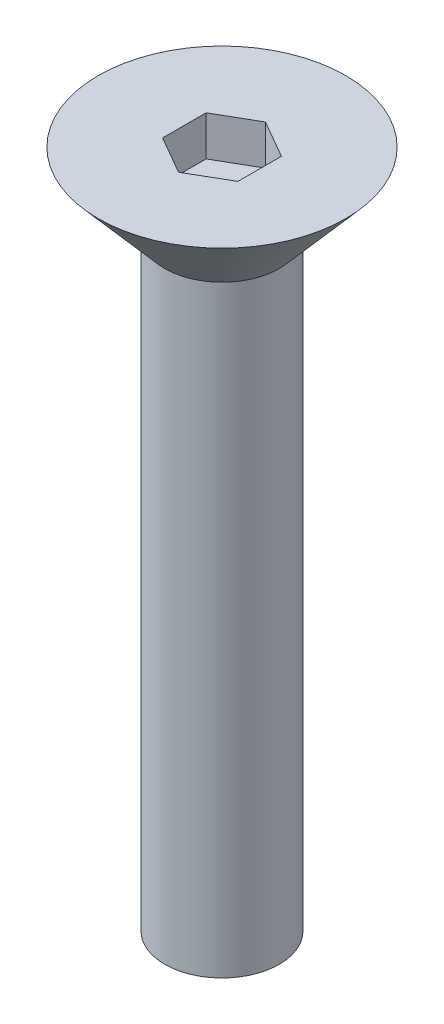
from build123d import *

# Parameters (mm, degrees)
HEXCUT_DEPTH = 1.68402


with BuildPart() as part:
    # Sketch1 → Screw (revolve)
    with BuildSketch(Plane.XY, mode=Mode.PRIVATE) as screw_sk:
        Polygon((0, 0), (5.2197, 0), (2.413, -3.228739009), (2.413, -28.628739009), (0, -28.628739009), align=None)
    revolve(screw_sk.sketch.rotate(Axis((0, 25.4, 0), (0, -1, 0)), 90), axis=Axis((0, 25.4, 0), (0, -1, 0)))

    # Sketch2 → HexCut (cut)
    with BuildSketch(Plane(origin=(0, 0, 0), x_dir=(-1, 0, 0), z_dir=(0, 1, 0))):
        Polygon((-1.5875, -0.916543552), (-1.5875, 0.916543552), (0, 1.833087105), (1.5875, 0.916543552), (1.5875, -0.916543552), (0, -1.833087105), align=None)
    extrude(amount=-HEXCUT_DEPTH, mode=Mode.SUBTRACT)


solid = part.part
